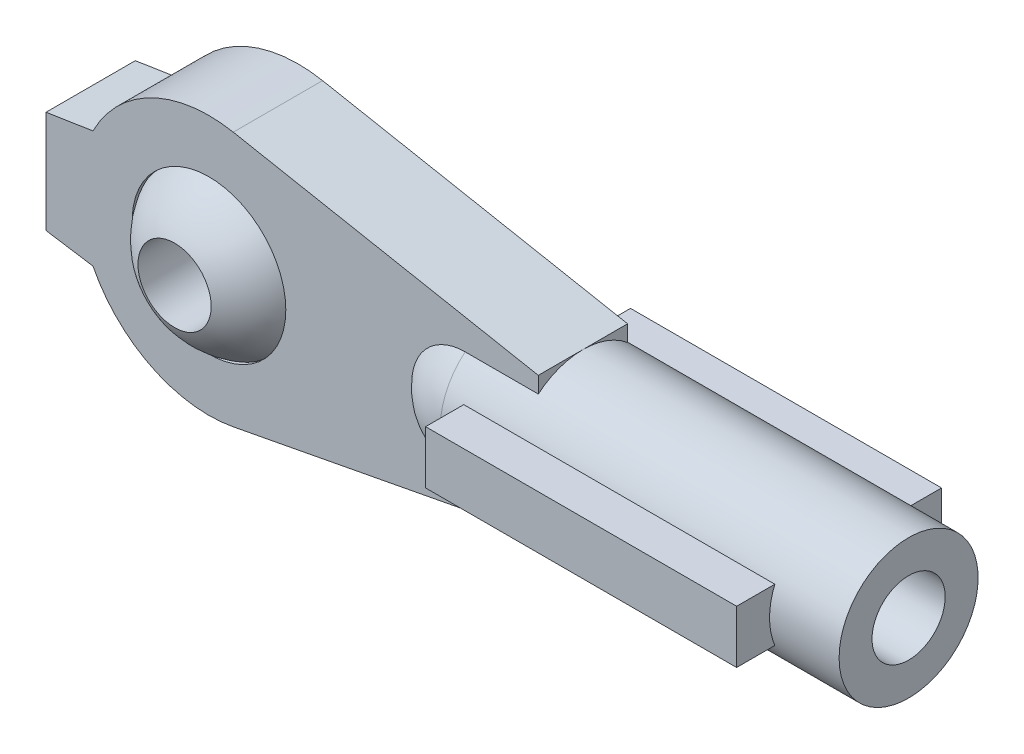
from build123d import *

# Parameters (mm, degrees)
ESQUISSE1_R                  = 2.1
BOSS_EXTRU_1_DEPTH           = 1.22
ESQUISSE3_R                  = 1
ENL_V_MAT_EXTRU_1_DEPTH      = 10
ENL_V_MAT_EXTRU_2_DEPTH      = 19.403176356
ENL_V_MAT_EXTRU_2_DEPTH_BACK = 19.403176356
ESQUISSE5_W                  = 6
ESQUISSE5_H                  = 1
ESQUISSE6_R                  = 1
ENL_V_MAT_EXTRU_3_DEPTH      = 19.81216096
BOSS_EXTRU_2_DEPTH           = 8.5


with BuildPart() as part:
    # Esquisse1 → Boss.-Extru.1 (new, symmetric)
    with BuildSketch(Plane.XY):
        with BuildLine():
            Line((9, -1.9), (9, 1.9))
            Line((9, 1.9), (0.664062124, 3.487337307))
            ThreePointArc((0.664062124, 3.487337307), (-1.568176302, 3.184858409), (-3.168990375, 1.6))
            Line((-3.168990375, 1.6), (-4.453513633, 1.4))
            Line((-4.453513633, 1.4), (-4.453513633, -1.4))
            Line((-4.453513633, -1.4), (-3.168990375, -1.6))
            ThreePointArc((-3.168990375, -1.6), (-1.568176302, -3.184858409), (0.664062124, -3.487337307))
            Line((0.664062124, -3.487337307), (9, -1.9))
        make_face()
        Circle(ESQUISSE1_R, mode=Mode.SUBTRACT)
    extrude(amount=BOSS_EXTRU_1_DEPTH, both=True)

    # Esquisse2 → R_volution1 (revolve)
    with BuildSketch(Plane.XY, mode=Mode.PRIVATE) as r_volution1_sk:
        with BuildLine():
            Line((7, 1.9), (17.9, 1.9))
            Line((17.9, 1.9), (17.9, 0))
            Line((17.9, 0), (5.1, 0))
            ThreePointArc((5.1, 0), (5.656497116, 1.343502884), (7, 1.9))
        make_face()
    revolve(r_volution1_sk.sketch.rotate(Axis((0, 0, 0), (1, 0, 0)), 90), axis=Axis((0, 0, 0), (1, 0, 0)))

    # Esquisse3 → Enl_v. mat.-Extru.1 (cut)
    with BuildSketch(Plane(origin=(17.9, 0, 0), x_dir=(0, 0, -1), z_dir=(1, 0, 0))):
        Circle(ESQUISSE3_R)
    extrude(amount=-ENL_V_MAT_EXTRU_1_DEPTH, mode=Mode.SUBTRACT)

    # Esquisse7 → Boss.-Extru.2 (add)
    with BuildSketch(Plane(origin=(16, 0, 0), x_dir=(0, 0, -1), z_dir=(1, 0, 0))):
        with BuildLine():
            Line((1.756238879, -0.725), (2.8, -0.725))
            Line((2.8, -0.725), (2.8, 0.725))
            Line((2.8, 0.725), (1.756238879, 0.725))
            ThreePointArc((1.756238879, 0.725), (1.9, 0), (1.756238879, -0.725))
        make_face()
        with BuildLine():
            Line((-2.8, 0.725), (-1.756238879, 0.725))
            ThreePointArc((-1.756238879, 0.725), (-1.9, 0), (-1.756238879, -0.725))
            Line((-1.756238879, -0.725), (-2.8, -0.725))
            Line((-2.8, -0.725), (-2.8, 0.725))
        make_face()
    extrude(amount=-BOSS_EXTRU_2_DEPTH)


with BuildPart() as body_2:
    # Esquisse4 → R_volution2 (revolve)
    with BuildSketch(Plane.XY):
        with BuildLine():
            Line((0, 2.38), (0, -2.38))
            ThreePointArc((0, -2.38), (2.38, 0), (0, 2.38))
        make_face()
    revolve(axis=Axis((0, 0, 0), (0, 1, 0)))

    # Esquisse5 → Enl_v. mat.-Extru.2 (cut, two sides: drawn at the far end of the back side and taken through both)
    with BuildSketch(Plane(origin=(0, 0, 0), x_dir=(1, 0, 0), z_dir=(0, 1, 0)).offset(-ENL_V_MAT_EXTRU_2_DEPTH_BACK)):
        with Locations((0, 2.69)):
            Rectangle(ESQUISSE5_W, ESQUISSE5_H)
        with Locations((0, -2.69)):
            Rectangle(ESQUISSE5_W, ESQUISSE5_H)
    extrude(amount=ENL_V_MAT_EXTRU_2_DEPTH + ENL_V_MAT_EXTRU_2_DEPTH_BACK, mode=Mode.SUBTRACT)

    # Esquisse6 → Enl_v. mat.-Extru.3 (cut, through all)
    with BuildSketch(Plane(origin=(0, 0, -2.19), x_dir=(-1, 0, 0), z_dir=(0, 0, -1))):
        with Locations(Location((0, 0, 0), (0, 0, 180))):
            Circle(ESQUISSE6_R)
    extrude(amount=-ENL_V_MAT_EXTRU_3_DEPTH, mode=Mode.SUBTRACT)


solid = Compound([part.part, body_2.part])
